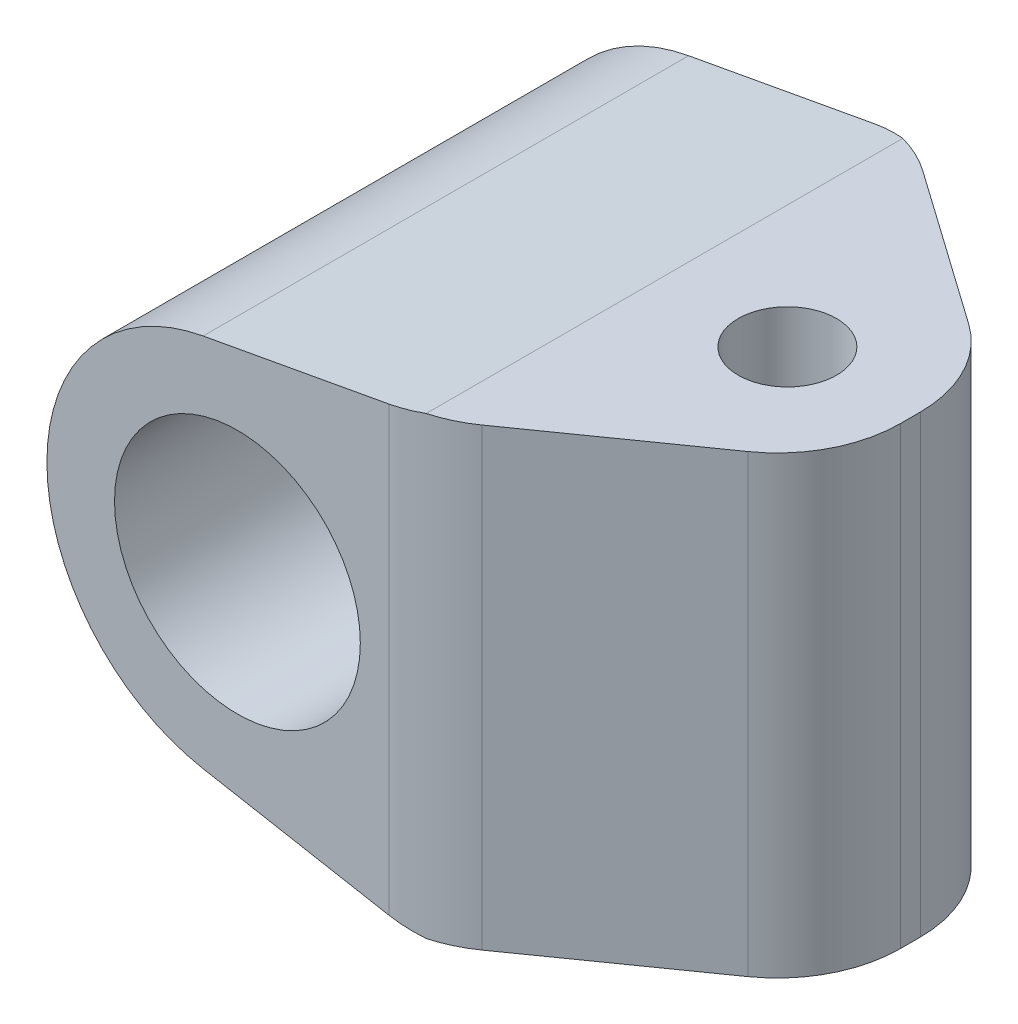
ISO-10303-21;
HEADER;
FILE_DESCRIPTION(('STEP AP214'),'2;1');
FILE_NAME('part.step','',(''),(''),'','','');
FILE_SCHEMA(('AUTOMOTIVE_DESIGN { 1 0 10303 214 1 1 1 1 }'));
ENDSEC;
DATA;
#1=APPLICATION_CONTEXT('core data for automotive mechanical design processes');
#2=APPLICATION_PROTOCOL_DEFINITION('international standard','automotive_design',2000,#1);
#3=PRODUCT_CONTEXT('',#1,'mechanical');
#4=PRODUCT('Part','Part','',(#3));
#5=PRODUCT_RELATED_PRODUCT_CATEGORY('part','',(#4));
#6=PRODUCT_DEFINITION_FORMATION('','',#4);
#7=PRODUCT_DEFINITION_CONTEXT('part definition',#1,'design');
#8=PRODUCT_DEFINITION('design','',#6,#7);
#9=PRODUCT_DEFINITION_SHAPE('','',#8);
#10=(LENGTH_UNIT() NAMED_UNIT(*) SI_UNIT(.MILLI.,.METRE.));
#11=(NAMED_UNIT(*) PLANE_ANGLE_UNIT() SI_UNIT($,.RADIAN.));
#12=(NAMED_UNIT(*) SI_UNIT($,.STERADIAN.) SOLID_ANGLE_UNIT());
#13=UNCERTAINTY_MEASURE_WITH_UNIT(LENGTH_MEASURE(1.E-05),#10,'distance_accuracy_value','');
#14=(GEOMETRIC_REPRESENTATION_CONTEXT(3) GLOBAL_UNCERTAINTY_ASSIGNED_CONTEXT((#13)) GLOBAL_UNIT_ASSIGNED_CONTEXT((#10,
#11,#12)) REPRESENTATION_CONTEXT('',''));
#15=CARTESIAN_POINT('',(0.,0.,0.));
#16=DIRECTION('',(0.,0.,1.));
#17=DIRECTION('',(1.,0.,0.));
#18=AXIS2_PLACEMENT_3D('',#15,#16,#17);
#19=CARTESIAN_POINT('',(35.,18.5,19.75));
#20=DIRECTION('',(1.,0.,0.));
#21=DIRECTION('',(0.,0.,-1.));
#22=AXIS2_PLACEMENT_3D('',#19,#20,#21);
#23=PLANE('',#22);
#24=DIRECTION('',(0.,0.,-1.));
#25=VECTOR('',#24,1.);
#26=CARTESIAN_POINT('',(35.,18.5,19.75));
#27=LINE('',#26,#25);
#28=CARTESIAN_POINT('',(35.,18.5,0.815245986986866));
#29=VERTEX_POINT('',#28);
#30=CARTESIAN_POINT('',(35.,18.5,-0.815245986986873));
#31=VERTEX_POINT('',#30);
#32=EDGE_CURVE('E163',#29,#31,#27,.T.);
#33=ORIENTED_EDGE('',*,*,#32,.F.);
#34=DIRECTION('',(0.,1.,0.));
#35=VECTOR('',#34,1.);
#36=CARTESIAN_POINT('',(35.,-20.,0.815245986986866));
#37=LINE('',#36,#35);
#38=CARTESIAN_POINT('',(35.,-18.5,0.815245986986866));
#39=VERTEX_POINT('',#38);
#40=EDGE_CURVE('E186',#39,#29,#37,.T.);
#41=ORIENTED_EDGE('',*,*,#40,.F.);
#42=DIRECTION('',(0.,0.,-1.));
#43=VECTOR('',#42,1.);
#44=CARTESIAN_POINT('',(35.,-18.5,19.75));
#45=LINE('',#44,#43);
#46=CARTESIAN_POINT('',(35.,-18.5,-0.815245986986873));
#47=VERTEX_POINT('',#46);
#48=EDGE_CURVE('E127',#39,#47,#45,.T.);
#49=ORIENTED_EDGE('',*,*,#48,.T.);
#50=DIRECTION('',(0.,1.,0.));
#51=VECTOR('',#50,1.);
#52=CARTESIAN_POINT('',(35.,-20.,-0.815245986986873));
#53=LINE('',#52,#51);
#54=EDGE_CURVE('E283',#47,#31,#53,.T.);
#55=ORIENTED_EDGE('',*,*,#54,.T.);
#56=EDGE_LOOP('',(#33,#41,#49,#55));
#57=FACE_BOUND('',#56,.T.);
#58=ADVANCED_FACE('F30',(#57),#23,.T.);
#59=CARTESIAN_POINT('',(0.,0.,19.75));
#60=DIRECTION('',(0.,0.,1.));
#61=DIRECTION('',(1.,0.,0.));
#62=AXIS2_PLACEMENT_3D('',#59,#60,#61);
#63=PLANE('',#62);
#64=CARTESIAN_POINT('',(0.,0.,19.75));
#65=DIRECTION('',(0.,0.,1.));
#66=DIRECTION('',(1.,0.,0.));
#67=AXIS2_PLACEMENT_3D('',#64,#65,#66);
#68=CIRCLE('',#67,10.);
#69=CARTESIAN_POINT('',(10.,0.,19.75));
#70=VERTEX_POINT('',#69);
#71=EDGE_CURVE('E222',#70,#70,#68,.T.);
#72=ORIENTED_EDGE('',*,*,#71,.F.);
#73=EDGE_LOOP('',(#72));
#74=FACE_BOUND('',#73,.T.);
#75=DIRECTION('',(-0.983688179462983,-0.179882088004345,0.));
#76=VECTOR('',#75,1.);
#77=CARTESIAN_POINT('',(15.,18.5,19.75));
#78=LINE('',#77,#76);
#79=CARTESIAN_POINT('',(12.3288943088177,18.0115483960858,19.75));
#80=VERTEX_POINT('',#79);
#81=CARTESIAN_POINT('',(-2.78817236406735,15.2471667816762,19.75));
#82=VERTEX_POINT('',#81);
#83=EDGE_CURVE('E142',#80,#82,#78,.T.);
#84=ORIENTED_EDGE('',*,*,#83,.T.);
#85=CARTESIAN_POINT('',(0.,0.,19.75));
#86=DIRECTION('',(0.,0.,1.));
#87=DIRECTION('',(1.,0.,0.));
#88=AXIS2_PLACEMENT_3D('',#85,#86,#87);
#89=CIRCLE('',#88,15.5);
#90=CARTESIAN_POINT('',(-2.78817236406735,-15.2471667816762,19.75));
#91=VERTEX_POINT('',#90);
#92=EDGE_CURVE('E145',#82,#91,#89,.T.);
#93=ORIENTED_EDGE('',*,*,#92,.T.);
#94=DIRECTION('',(-0.983688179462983,0.179882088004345,0.));
#95=VECTOR('',#94,1.);
#96=CARTESIAN_POINT('',(15.,-18.5,19.75));
#97=LINE('',#96,#95);
#98=CARTESIAN_POINT('',(12.3288943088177,-18.0115483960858,19.75));
#99=VERTEX_POINT('',#98);
#100=EDGE_CURVE('E152',#99,#91,#97,.T.);
#101=ORIENTED_EDGE('',*,*,#100,.F.);
#102=DIRECTION('',(0.,1.,0.));
#103=VECTOR('',#102,1.);
#104=CARTESIAN_POINT('',(12.3288943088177,-20.,19.75));
#105=LINE('',#104,#103);
#106=EDGE_CURVE('E45',#99,#80,#105,.T.);
#107=ORIENTED_EDGE('',*,*,#106,.T.);
#108=EDGE_LOOP('',(#84,#93,#101,#107));
#109=FACE_BOUND('',#108,.T.);
#110=ADVANCED_FACE('F234',(#74,#109),#63,.T.);
#111=CARTESIAN_POINT('',(0.,0.,-19.75));
#112=DIRECTION('',(0.,0.,1.));
#113=DIRECTION('',(1.,0.,0.));
#114=AXIS2_PLACEMENT_3D('',#111,#112,#113);
#115=PLANE('',#114);
#116=CARTESIAN_POINT('',(0.,0.,-19.75));
#117=DIRECTION('',(0.,0.,1.));
#118=DIRECTION('',(1.,0.,0.));
#119=AXIS2_PLACEMENT_3D('',#116,#117,#118);
#120=CIRCLE('',#119,10.);
#121=CARTESIAN_POINT('',(10.,0.,-19.75));
#122=VERTEX_POINT('',#121);
#123=EDGE_CURVE('E219',#122,#122,#120,.T.);
#124=ORIENTED_EDGE('',*,*,#123,.T.);
#125=EDGE_LOOP('',(#124));
#126=FACE_BOUND('',#125,.T.);
#127=CARTESIAN_POINT('',(0.,0.,-19.75));
#128=DIRECTION('',(0.,0.,1.));
#129=DIRECTION('',(1.,0.,0.));
#130=AXIS2_PLACEMENT_3D('',#127,#128,#129);
#131=CIRCLE('',#130,15.5);
#132=CARTESIAN_POINT('',(-2.78817236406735,15.2471667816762,-19.75));
#133=VERTEX_POINT('',#132);
#134=CARTESIAN_POINT('',(-2.78817236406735,-15.2471667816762,-19.75));
#135=VERTEX_POINT('',#134);
#136=EDGE_CURVE('E143',#133,#135,#131,.T.);
#137=ORIENTED_EDGE('',*,*,#136,.F.);
#138=DIRECTION('',(-0.983688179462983,-0.179882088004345,0.));
#139=VECTOR('',#138,1.);
#140=CARTESIAN_POINT('',(15.,18.5,-19.75));
#141=LINE('',#140,#139);
#142=CARTESIAN_POINT('',(12.3288943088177,18.0115483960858,-19.75));
#143=VERTEX_POINT('',#142);
#144=EDGE_CURVE('E135',#143,#133,#141,.T.);
#145=ORIENTED_EDGE('',*,*,#144,.F.);
#146=DIRECTION('',(0.,1.,0.));
#147=VECTOR('',#146,1.);
#148=CARTESIAN_POINT('',(12.3288943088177,-20.,-19.75));
#149=LINE('',#148,#147);
#150=CARTESIAN_POINT('',(12.3288943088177,-18.0115483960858,-19.75));
#151=VERTEX_POINT('',#150);
#152=EDGE_CURVE('E120',#151,#143,#149,.T.);
#153=ORIENTED_EDGE('',*,*,#152,.F.);
#154=DIRECTION('',(-0.983688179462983,0.179882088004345,0.));
#155=VECTOR('',#154,1.);
#156=CARTESIAN_POINT('',(15.,-18.5,-19.75));
#157=LINE('',#156,#155);
#158=EDGE_CURVE('E133',#151,#135,#157,.T.);
#159=ORIENTED_EDGE('',*,*,#158,.T.);
#160=EDGE_LOOP('',(#137,#145,#153,#159));
#161=FACE_BOUND('',#160,.T.);
#162=ADVANCED_FACE('F132',(#126,#161),#115,.F.);
#163=CARTESIAN_POINT('',(15.,-18.5,19.75));
#164=DIRECTION('',(0.,1.,0.));
#165=DIRECTION('',(0.,0.,1.));
#166=AXIS2_PLACEMENT_3D('',#163,#164,#165);
#167=PLANE('',#166);
#168=CARTESIAN_POINT('',(25.,-18.5,0.));
#169=DIRECTION('',(0.,1.,0.));
#170=DIRECTION('',(0.,0.,1.));
#171=AXIS2_PLACEMENT_3D('',#168,#169,#170);
#172=CIRCLE('',#171,4.);
#173=CARTESIAN_POINT('',(25.,-18.5,4.));
#174=VERTEX_POINT('',#173);
#175=EDGE_CURVE('E170',#174,#174,#172,.T.);
#176=ORIENTED_EDGE('',*,*,#175,.T.);
#177=EDGE_LOOP('',(#176));
#178=FACE_BOUND('',#177,.T.);
#179=DIRECTION('',(0.817258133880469,0.,-0.576271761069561));
#180=VECTOR('',#179,1.);
#181=CARTESIAN_POINT('',(15.1660445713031,-18.5,19.9854813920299));
#182=LINE('',#181,#180);
#183=CARTESIAN_POINT('',(18.0916119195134,-18.5,17.9225813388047));
#184=VERTEX_POINT('',#183);
#185=CARTESIAN_POINT('',(30.7627176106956,-18.5,8.98782732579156));
#186=VERTEX_POINT('',#185);
#187=EDGE_CURVE('E171',#184,#186,#182,.T.);
#188=ORIENTED_EDGE('',*,*,#187,.F.);
#189=CARTESIAN_POINT('',(12.3288943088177,-18.5,9.74999999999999));
#190=DIRECTION('',(0.,1.,0.));
#191=DIRECTION('',(0.,0.,1.));
#192=AXIS2_PLACEMENT_3D('',#189,#190,#191);
#193=CIRCLE('',#192,10.);
#194=CARTESIAN_POINT('',(15.,-18.5,19.3866588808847));
#195=VERTEX_POINT('',#194);
#196=EDGE_CURVE('E208',#184,#195,#193,.F.);
#197=ORIENTED_EDGE('',*,*,#196,.T.);
#198=DIRECTION('',(0.,0.,-1.));
#199=VECTOR('',#198,1.);
#200=CARTESIAN_POINT('',(15.,-18.5,19.75));
#201=LINE('',#200,#199);
#202=CARTESIAN_POINT('',(15.,-18.5,-19.3866588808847));
#203=VERTEX_POINT('',#202);
#204=EDGE_CURVE('E154',#195,#203,#201,.T.);
#205=ORIENTED_EDGE('',*,*,#204,.T.);
#206=CARTESIAN_POINT('',(12.3288943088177,-18.5,-9.75));
#207=DIRECTION('',(0.,1.,0.));
#208=DIRECTION('',(0.,0.,1.));
#209=AXIS2_PLACEMENT_3D('',#206,#207,#208);
#210=CIRCLE('',#209,10.);
#211=CARTESIAN_POINT('',(18.0916119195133,-18.5,-17.9225813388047));
#212=VERTEX_POINT('',#211);
#213=EDGE_CURVE('E53',#203,#212,#210,.F.);
#214=ORIENTED_EDGE('',*,*,#213,.T.);
#215=DIRECTION('',(-0.817258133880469,0.,-0.576271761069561));
#216=VECTOR('',#215,1.);
#217=CARTESIAN_POINT('',(33.7690745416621,-18.5,-6.86796025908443));
#218=LINE('',#217,#216);
#219=CARTESIAN_POINT('',(30.7627176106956,-18.5,-8.98782732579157));
#220=VERTEX_POINT('',#219);
#221=EDGE_CURVE('E203',#220,#212,#218,.T.);
#222=ORIENTED_EDGE('',*,*,#221,.F.);
#223=CARTESIAN_POINT('',(25.,-18.5,-0.815245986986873));
#224=DIRECTION('',(0.,1.,0.));
#225=DIRECTION('',(0.,0.,1.));
#226=AXIS2_PLACEMENT_3D('',#223,#224,#225);
#227=CIRCLE('',#226,10.);
#228=EDGE_CURVE('E206',#220,#47,#227,.F.);
#229=ORIENTED_EDGE('',*,*,#228,.T.);
#230=ORIENTED_EDGE('',*,*,#48,.F.);
#231=CARTESIAN_POINT('',(25.,-18.5,0.815245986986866));
#232=DIRECTION('',(0.,1.,0.));
#233=DIRECTION('',(0.,0.,1.));
#234=AXIS2_PLACEMENT_3D('',#231,#232,#233);
#235=CIRCLE('',#234,10.);
#236=EDGE_CURVE('E214',#39,#186,#235,.F.);
#237=ORIENTED_EDGE('',*,*,#236,.T.);
#238=EDGE_LOOP('',(#188,#197,#205,#214,#222,#229,#230,#237));
#239=FACE_BOUND('',#238,.T.);
#240=ADVANCED_FACE('F32',(#178,#239),#167,.F.);
#241=CARTESIAN_POINT('',(15.,18.5,19.75));
#242=DIRECTION('',(0.,1.,0.));
#243=DIRECTION('',(-1.,0.,0.));
#244=AXIS2_PLACEMENT_3D('',#241,#242,#243);
#245=PLANE('',#244);
#246=CARTESIAN_POINT('',(12.3288943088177,18.5,9.74999999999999));
#247=DIRECTION('',(0.,1.,0.));
#248=DIRECTION('',(-1.,0.,0.));
#249=AXIS2_PLACEMENT_3D('',#246,#247,#248);
#250=CIRCLE('',#249,10.);
#251=CARTESIAN_POINT('',(18.0916119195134,18.5,17.9225813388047));
#252=VERTEX_POINT('',#251);
#253=CARTESIAN_POINT('',(15.,18.5,19.3866588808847));
#254=VERTEX_POINT('',#253);
#255=EDGE_CURVE('E200',#252,#254,#250,.F.);
#256=ORIENTED_EDGE('',*,*,#255,.F.);
#257=DIRECTION('',(0.817258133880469,0.,-0.576271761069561));
#258=VECTOR('',#257,1.);
#259=CARTESIAN_POINT('',(15.1660445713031,18.5,19.9854813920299));
#260=LINE('',#259,#258);
#261=CARTESIAN_POINT('',(30.7627176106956,18.5,8.98782732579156));
#262=VERTEX_POINT('',#261);
#263=EDGE_CURVE('E11',#252,#262,#260,.T.);
#264=ORIENTED_EDGE('',*,*,#263,.T.);
#265=CARTESIAN_POINT('',(25.,18.5,0.815245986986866));
#266=DIRECTION('',(0.,1.,0.));
#267=DIRECTION('',(-1.,0.,0.));
#268=AXIS2_PLACEMENT_3D('',#265,#266,#267);
#269=CIRCLE('',#268,10.);
#270=EDGE_CURVE('E38',#29,#262,#269,.F.);
#271=ORIENTED_EDGE('',*,*,#270,.F.);
#272=ORIENTED_EDGE('',*,*,#32,.T.);
#273=CARTESIAN_POINT('',(25.,18.5,-0.815245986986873));
#274=DIRECTION('',(0.,1.,0.));
#275=DIRECTION('',(-1.,0.,0.));
#276=AXIS2_PLACEMENT_3D('',#273,#274,#275);
#277=CIRCLE('',#276,10.);
#278=CARTESIAN_POINT('',(30.7627176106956,18.5,-8.98782732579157));
#279=VERTEX_POINT('',#278);
#280=EDGE_CURVE('E177',#279,#31,#277,.F.);
#281=ORIENTED_EDGE('',*,*,#280,.F.);
#282=DIRECTION('',(-0.817258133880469,0.,-0.576271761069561));
#283=VECTOR('',#282,1.);
#284=CARTESIAN_POINT('',(33.7690745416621,18.5,-6.86796025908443));
#285=LINE('',#284,#283);
#286=CARTESIAN_POINT('',(18.0916119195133,18.5,-17.9225813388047));
#287=VERTEX_POINT('',#286);
#288=EDGE_CURVE('E174',#279,#287,#285,.T.);
#289=ORIENTED_EDGE('',*,*,#288,.T.);
#290=CARTESIAN_POINT('',(12.3288943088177,18.5,-9.75));
#291=DIRECTION('',(0.,1.,0.));
#292=DIRECTION('',(-1.,0.,0.));
#293=AXIS2_PLACEMENT_3D('',#290,#291,#292);
#294=CIRCLE('',#293,10.);
#295=CARTESIAN_POINT('',(15.,18.5,-19.3866588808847));
#296=VERTEX_POINT('',#295);
#297=EDGE_CURVE('E293',#296,#287,#294,.F.);
#298=ORIENTED_EDGE('',*,*,#297,.F.);
#299=DIRECTION('',(0.,0.,-1.));
#300=VECTOR('',#299,1.);
#301=CARTESIAN_POINT('',(15.,18.5,19.75));
#302=LINE('',#301,#300);
#303=EDGE_CURVE('E160',#254,#296,#302,.T.);
#304=ORIENTED_EDGE('',*,*,#303,.F.);
#305=EDGE_LOOP('',(#256,#264,#271,#272,#281,#289,#298,#304));
#306=FACE_BOUND('',#305,.T.);
#307=CARTESIAN_POINT('',(25.,18.5,0.));
#308=DIRECTION('',(0.,1.,0.));
#309=DIRECTION('',(-1.,0.,0.));
#310=AXIS2_PLACEMENT_3D('',#307,#308,#309);
#311=CIRCLE('',#310,4.);
#312=CARTESIAN_POINT('',(21.,18.5,0.));
#313=VERTEX_POINT('',#312);
#314=EDGE_CURVE('E168',#313,#313,#311,.T.);
#315=ORIENTED_EDGE('',*,*,#314,.F.);
#316=EDGE_LOOP('',(#315));
#317=FACE_BOUND('',#316,.T.);
#318=ADVANCED_FACE('F197',(#306,#317),#245,.T.);
#319=CARTESIAN_POINT('',(15.,18.5,19.75));
#320=DIRECTION('',(0.179882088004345,-0.983688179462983,0.));
#321=DIRECTION('',(0.983688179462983,0.179882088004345,0.));
#322=AXIS2_PLACEMENT_3D('',#319,#320,#321);
#323=PLANE('',#322);
#324=ORIENTED_EDGE('',*,*,#83,.F.);
#325=CARTESIAN_POINT('',(12.3288943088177,18.0115483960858,9.74999999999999));
#326=DIRECTION('',(0.179882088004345,-0.983688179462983,0.));
#327=DIRECTION('',(0.983688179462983,0.179882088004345,0.));
#328=AXIS2_PLACEMENT_3D('',#325,#326,#327);
#329=ELLIPSE('',#328,10.1658230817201,10.);
#330=EDGE_CURVE('E204',#80,#254,#329,.F.);
#331=ORIENTED_EDGE('',*,*,#330,.T.);
#332=ORIENTED_EDGE('',*,*,#303,.T.);
#333=CARTESIAN_POINT('',(12.3288943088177,18.0115483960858,-9.75));
#334=DIRECTION('',(0.179882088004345,-0.983688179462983,0.));
#335=DIRECTION('',(0.983688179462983,0.179882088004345,0.));
#336=AXIS2_PLACEMENT_3D('',#333,#334,#335);
#337=ELLIPSE('',#336,10.1658230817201,10.);
#338=EDGE_CURVE('E229',#296,#143,#337,.F.);
#339=ORIENTED_EDGE('',*,*,#338,.T.);
#340=ORIENTED_EDGE('',*,*,#144,.T.);
#341=DIRECTION('',(0.,0.,-1.));
#342=VECTOR('',#341,1.);
#343=CARTESIAN_POINT('',(-2.78817236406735,15.2471667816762,19.75));
#344=LINE('',#343,#342);
#345=EDGE_CURVE('E157',#82,#133,#344,.T.);
#346=ORIENTED_EDGE('',*,*,#345,.F.);
#347=EDGE_LOOP('',(#324,#331,#332,#339,#340,#346));
#348=FACE_BOUND('',#347,.T.);
#349=ADVANCED_FACE('F227',(#348),#323,.F.);
#350=CARTESIAN_POINT('',(0.,0.,19.75));
#351=DIRECTION('',(0.,0.,-1.));
#352=DIRECTION('',(-1.,0.,0.));
#353=AXIS2_PLACEMENT_3D('',#350,#351,#352);
#354=CYLINDRICAL_SURFACE('',#353,15.5);
#355=ORIENTED_EDGE('',*,*,#136,.T.);
#356=DIRECTION('',(0.,0.,-1.));
#357=VECTOR('',#356,1.);
#358=CARTESIAN_POINT('',(-2.78817236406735,-15.2471667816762,19.75));
#359=LINE('',#358,#357);
#360=EDGE_CURVE('E140',#91,#135,#359,.T.);
#361=ORIENTED_EDGE('',*,*,#360,.F.);
#362=ORIENTED_EDGE('',*,*,#92,.F.);
#363=ORIENTED_EDGE('',*,*,#345,.T.);
#364=EDGE_LOOP('',(#355,#361,#362,#363));
#365=FACE_BOUND('',#364,.T.);
#366=ADVANCED_FACE('F231',(#365),#354,.T.);
#367=CARTESIAN_POINT('',(15.,-18.5,19.75));
#368=DIRECTION('',(-0.179882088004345,-0.983688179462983,0.));
#369=DIRECTION('',(0.983688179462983,-0.179882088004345,0.));
#370=AXIS2_PLACEMENT_3D('',#367,#368,#369);
#371=PLANE('',#370);
#372=CARTESIAN_POINT('',(12.3288943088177,-18.0115483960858,9.74999999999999));
#373=DIRECTION('',(-0.179882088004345,-0.983688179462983,0.));
#374=DIRECTION('',(-0.983688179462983,0.179882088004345,0.));
#375=AXIS2_PLACEMENT_3D('',#372,#373,#374);
#376=ELLIPSE('',#375,10.1658230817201,10.);
#377=EDGE_CURVE('E126',#99,#195,#376,.F.);
#378=ORIENTED_EDGE('',*,*,#377,.F.);
#379=ORIENTED_EDGE('',*,*,#100,.T.);
#380=ORIENTED_EDGE('',*,*,#360,.T.);
#381=ORIENTED_EDGE('',*,*,#158,.F.);
#382=CARTESIAN_POINT('',(12.3288943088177,-18.0115483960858,-9.75));
#383=DIRECTION('',(-0.179882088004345,-0.983688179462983,0.));
#384=DIRECTION('',(-0.983688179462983,0.179882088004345,0.));
#385=AXIS2_PLACEMENT_3D('',#382,#383,#384);
#386=ELLIPSE('',#385,10.1658230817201,10.);
#387=EDGE_CURVE('E117',#203,#151,#386,.F.);
#388=ORIENTED_EDGE('',*,*,#387,.F.);
#389=ORIENTED_EDGE('',*,*,#204,.F.);
#390=EDGE_LOOP('',(#378,#379,#380,#381,#388,#389));
#391=FACE_BOUND('',#390,.T.);
#392=ADVANCED_FACE('F138',(#391),#371,.T.);
#393=CARTESIAN_POINT('',(0.,0.,19.75));
#394=DIRECTION('',(0.,0.,-1.));
#395=DIRECTION('',(-1.,0.,0.));
#396=AXIS2_PLACEMENT_3D('',#393,#394,#395);
#397=CYLINDRICAL_SURFACE('',#396,10.);
#398=ORIENTED_EDGE('',*,*,#71,.T.);
#399=EDGE_LOOP('',(#398));
#400=FACE_BOUND('',#399,.T.);
#401=ORIENTED_EDGE('',*,*,#123,.F.);
#402=EDGE_LOOP('',(#401));
#403=FACE_BOUND('',#402,.T.);
#404=ADVANCED_FACE('F259',(#400,#403),#397,.F.);
#405=CARTESIAN_POINT('',(25.,-20.,0.));
#406=DIRECTION('',(0.,1.,0.));
#407=DIRECTION('',(-1.,0.,0.));
#408=AXIS2_PLACEMENT_3D('',#405,#406,#407);
#409=CYLINDRICAL_SURFACE('',#408,4.);
#410=ORIENTED_EDGE('',*,*,#314,.T.);
#411=EDGE_LOOP('',(#410));
#412=FACE_BOUND('',#411,.T.);
#413=ORIENTED_EDGE('',*,*,#175,.F.);
#414=EDGE_LOOP('',(#413));
#415=FACE_BOUND('',#414,.T.);
#416=ADVANCED_FACE('F265',(#412,#415),#409,.F.);
#417=CARTESIAN_POINT('',(12.3288943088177,-20.,-9.75));
#418=DIRECTION('',(0.,1.,0.));
#419=DIRECTION('',(-1.,0.,0.));
#420=AXIS2_PLACEMENT_3D('',#417,#418,#419);
#421=CYLINDRICAL_SURFACE('',#420,10.);
#422=ORIENTED_EDGE('',*,*,#297,.T.);
#423=DIRECTION('',(0.,1.,0.));
#424=VECTOR('',#423,1.);
#425=CARTESIAN_POINT('',(18.0916119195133,-20.,-17.9225813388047));
#426=LINE('',#425,#424);
#427=EDGE_CURVE('E136',#212,#287,#426,.T.);
#428=ORIENTED_EDGE('',*,*,#427,.F.);
#429=ORIENTED_EDGE('',*,*,#213,.F.);
#430=ORIENTED_EDGE('',*,*,#387,.T.);
#431=ORIENTED_EDGE('',*,*,#152,.T.);
#432=ORIENTED_EDGE('',*,*,#338,.F.);
#433=EDGE_LOOP('',(#422,#428,#429,#430,#431,#432));
#434=FACE_BOUND('',#433,.T.);
#435=ADVANCED_FACE('F119',(#434),#421,.T.);
#436=CARTESIAN_POINT('',(30.7627176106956,-20.,-8.98782732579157));
#437=DIRECTION('',(0.576271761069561,0.,-0.817258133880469));
#438=DIRECTION('',(-0.817258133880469,0.,-0.576271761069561));
#439=AXIS2_PLACEMENT_3D('',#436,#437,#438);
#440=PLANE('',#439);
#441=ORIENTED_EDGE('',*,*,#221,.T.);
#442=ORIENTED_EDGE('',*,*,#427,.T.);
#443=ORIENTED_EDGE('',*,*,#288,.F.);
#444=DIRECTION('',(0.,1.,0.));
#445=VECTOR('',#444,1.);
#446=CARTESIAN_POINT('',(30.7627176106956,-20.,-8.98782732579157));
#447=LINE('',#446,#445);
#448=EDGE_CURVE('E285',#220,#279,#447,.T.);
#449=ORIENTED_EDGE('',*,*,#448,.F.);
#450=EDGE_LOOP('',(#441,#442,#443,#449));
#451=FACE_BOUND('',#450,.T.);
#452=ADVANCED_FACE('F272',(#451),#440,.T.);
#453=CARTESIAN_POINT('',(25.,-20.,-0.815245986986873));
#454=DIRECTION('',(0.,1.,0.));
#455=DIRECTION('',(-1.,0.,0.));
#456=AXIS2_PLACEMENT_3D('',#453,#454,#455);
#457=CYLINDRICAL_SURFACE('',#456,10.);
#458=ORIENTED_EDGE('',*,*,#448,.T.);
#459=ORIENTED_EDGE('',*,*,#280,.T.);
#460=ORIENTED_EDGE('',*,*,#54,.F.);
#461=ORIENTED_EDGE('',*,*,#228,.F.);
#462=EDGE_LOOP('',(#458,#459,#460,#461));
#463=FACE_BOUND('',#462,.T.);
#464=ADVANCED_FACE('F302',(#463),#457,.T.);
#465=CARTESIAN_POINT('',(18.0916119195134,-20.,17.9225813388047));
#466=DIRECTION('',(0.576271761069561,0.,0.817258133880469));
#467=DIRECTION('',(0.817258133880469,0.,-0.576271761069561));
#468=AXIS2_PLACEMENT_3D('',#465,#466,#467);
#469=PLANE('',#468);
#470=ORIENTED_EDGE('',*,*,#187,.T.);
#471=DIRECTION('',(0.,1.,0.));
#472=VECTOR('',#471,1.);
#473=CARTESIAN_POINT('',(30.7627176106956,-20.,8.98782732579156));
#474=LINE('',#473,#472);
#475=EDGE_CURVE('E183',#186,#262,#474,.T.);
#476=ORIENTED_EDGE('',*,*,#475,.T.);
#477=ORIENTED_EDGE('',*,*,#263,.F.);
#478=DIRECTION('',(0.,1.,0.));
#479=VECTOR('',#478,1.);
#480=CARTESIAN_POINT('',(18.0916119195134,-20.,17.9225813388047));
#481=LINE('',#480,#479);
#482=EDGE_CURVE('E194',#184,#252,#481,.T.);
#483=ORIENTED_EDGE('',*,*,#482,.F.);
#484=EDGE_LOOP('',(#470,#476,#477,#483));
#485=FACE_BOUND('',#484,.T.);
#486=ADVANCED_FACE('F190',(#485),#469,.T.);
#487=CARTESIAN_POINT('',(25.,-20.,0.815245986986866));
#488=DIRECTION('',(0.,1.,0.));
#489=DIRECTION('',(-1.,0.,0.));
#490=AXIS2_PLACEMENT_3D('',#487,#488,#489);
#491=CYLINDRICAL_SURFACE('',#490,10.);
#492=ORIENTED_EDGE('',*,*,#40,.T.);
#493=ORIENTED_EDGE('',*,*,#270,.T.);
#494=ORIENTED_EDGE('',*,*,#475,.F.);
#495=ORIENTED_EDGE('',*,*,#236,.F.);
#496=EDGE_LOOP('',(#492,#493,#494,#495));
#497=FACE_BOUND('',#496,.T.);
#498=ADVANCED_FACE('F182',(#497),#491,.T.);
#499=CARTESIAN_POINT('',(12.3288943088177,-20.,9.74999999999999));
#500=DIRECTION('',(0.,1.,0.));
#501=DIRECTION('',(-1.,0.,0.));
#502=AXIS2_PLACEMENT_3D('',#499,#500,#501);
#503=CYLINDRICAL_SURFACE('',#502,10.);
#504=ORIENTED_EDGE('',*,*,#255,.T.);
#505=ORIENTED_EDGE('',*,*,#330,.F.);
#506=ORIENTED_EDGE('',*,*,#106,.F.);
#507=ORIENTED_EDGE('',*,*,#377,.T.);
#508=ORIENTED_EDGE('',*,*,#196,.F.);
#509=ORIENTED_EDGE('',*,*,#482,.T.);
#510=EDGE_LOOP('',(#504,#505,#506,#507,#508,#509));
#511=FACE_BOUND('',#510,.T.);
#512=ADVANCED_FACE('F235',(#511),#503,.T.);
#513=CLOSED_SHELL('',(#58,#110,#162,#240,#318,#349,#366,#392,#404,#416,#435,#452,#464,#486,#498,#512));
#514=MANIFOLD_SOLID_BREP('B2',#513);
#515=ADVANCED_BREP_SHAPE_REPRESENTATION('',(#18,#514),#14);
#516=SHAPE_DEFINITION_REPRESENTATION(#9,#515);
ENDSEC;
END-ISO-10303-21;
